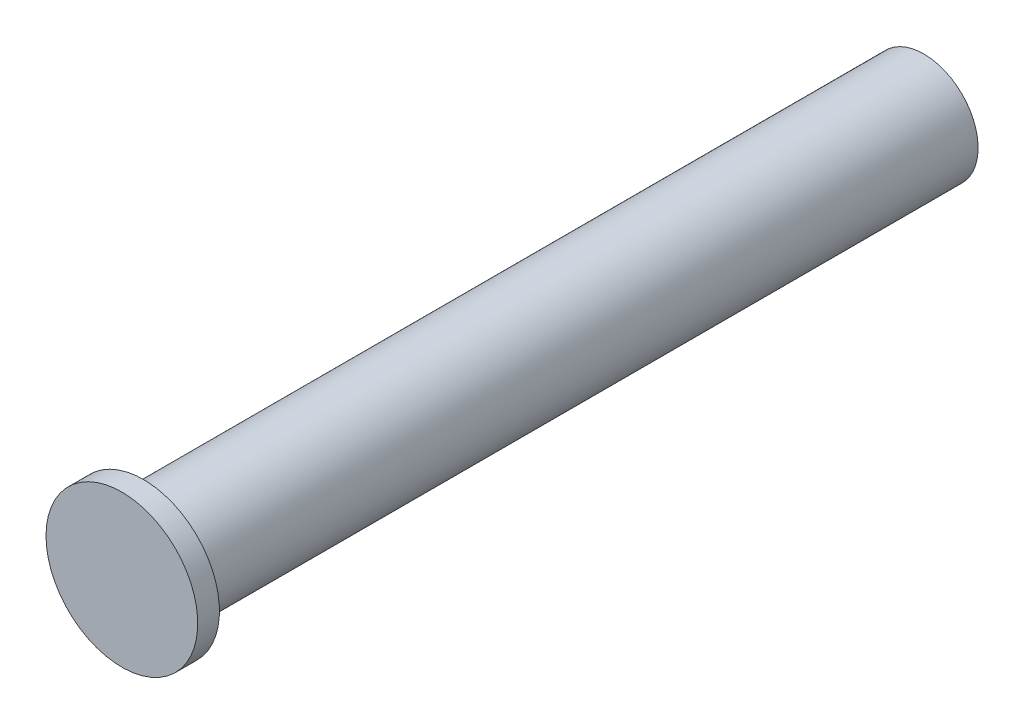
ISO-10303-21;
HEADER;
FILE_DESCRIPTION(('STEP AP214'),'2;1');
FILE_NAME('part.step','',(''),(''),'','','');
FILE_SCHEMA(('AUTOMOTIVE_DESIGN { 1 0 10303 214 1 1 1 1 }'));
ENDSEC;
DATA;
#1=APPLICATION_CONTEXT('core data for automotive mechanical design processes');
#2=APPLICATION_PROTOCOL_DEFINITION('international standard','automotive_design',2000,#1);
#3=PRODUCT_CONTEXT('',#1,'mechanical');
#4=PRODUCT('Part','Part','',(#3));
#5=PRODUCT_RELATED_PRODUCT_CATEGORY('part','',(#4));
#6=PRODUCT_DEFINITION_FORMATION('','',#4);
#7=PRODUCT_DEFINITION_CONTEXT('part definition',#1,'design');
#8=PRODUCT_DEFINITION('design','',#6,#7);
#9=PRODUCT_DEFINITION_SHAPE('','',#8);
#10=(LENGTH_UNIT() NAMED_UNIT(*) SI_UNIT(.MILLI.,.METRE.));
#11=(NAMED_UNIT(*) PLANE_ANGLE_UNIT() SI_UNIT($,.RADIAN.));
#12=(NAMED_UNIT(*) SI_UNIT($,.STERADIAN.) SOLID_ANGLE_UNIT());
#13=UNCERTAINTY_MEASURE_WITH_UNIT(LENGTH_MEASURE(1.E-05),#10,'distance_accuracy_value','');
#14=(GEOMETRIC_REPRESENTATION_CONTEXT(3) GLOBAL_UNCERTAINTY_ASSIGNED_CONTEXT((#13)) GLOBAL_UNIT_ASSIGNED_CONTEXT((#10,
#11,#12)) REPRESENTATION_CONTEXT('',''));
#15=CARTESIAN_POINT('',(0.,0.,0.));
#16=DIRECTION('',(0.,0.,1.));
#17=DIRECTION('',(1.,0.,0.));
#18=AXIS2_PLACEMENT_3D('',#15,#16,#17);
#19=CARTESIAN_POINT('',(0.,0.,0.));
#20=DIRECTION('',(0.,0.,-1.));
#21=DIRECTION('',(-1.,0.,0.));
#22=AXIS2_PLACEMENT_3D('',#19,#20,#21);
#23=PLANE('',#22);
#24=CARTESIAN_POINT('',(0.,0.,0.));
#25=DIRECTION('',(0.,0.,-1.));
#26=DIRECTION('',(-1.,0.,0.));
#27=AXIS2_PLACEMENT_3D('',#24,#25,#26);
#28=CIRCLE('',#27,7.);
#29=CARTESIAN_POINT('',(-7.,0.,0.));
#30=VERTEX_POINT('',#29);
#31=EDGE_CURVE('E10',#30,#30,#28,.T.);
#32=ORIENTED_EDGE('',*,*,#31,.F.);
#33=EDGE_LOOP('',(#32));
#34=FACE_BOUND('',#33,.T.);
#35=ADVANCED_FACE('F29',(#34),#23,.F.);
#36=CARTESIAN_POINT('',(0.,0.,-74.));
#37=DIRECTION('',(0.,0.,-1.));
#38=DIRECTION('',(-1.,0.,0.));
#39=AXIS2_PLACEMENT_3D('',#36,#37,#38);
#40=CYLINDRICAL_SURFACE('',#39,7.);
#41=CARTESIAN_POINT('',(0.,0.,-2.));
#42=DIRECTION('',(0.,0.,-1.));
#43=DIRECTION('',(-1.,0.,0.));
#44=AXIS2_PLACEMENT_3D('',#41,#42,#43);
#45=CIRCLE('',#44,7.);
#46=CARTESIAN_POINT('',(-7.,0.,-2.));
#47=VERTEX_POINT('',#46);
#48=EDGE_CURVE('E35',#47,#47,#45,.T.);
#49=ORIENTED_EDGE('',*,*,#48,.F.);
#50=EDGE_LOOP('',(#49));
#51=FACE_BOUND('',#50,.T.);
#52=ORIENTED_EDGE('',*,*,#31,.T.);
#53=EDGE_LOOP('',(#52));
#54=FACE_BOUND('',#53,.T.);
#55=ADVANCED_FACE('F59',(#51,#54),#40,.T.);
#56=CARTESIAN_POINT('',(7.,0.,-2.));
#57=DIRECTION('',(0.,0.,1.));
#58=DIRECTION('',(1.,0.,0.));
#59=AXIS2_PLACEMENT_3D('',#56,#57,#58);
#60=PLANE('',#59);
#61=CARTESIAN_POINT('',(0.,0.,-2.));
#62=DIRECTION('',(0.,0.,-1.));
#63=DIRECTION('',(-1.,0.,0.));
#64=AXIS2_PLACEMENT_3D('',#61,#62,#63);
#65=CIRCLE('',#64,5.00000000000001);
#66=CARTESIAN_POINT('',(-5.00000000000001,0.,-2.));
#67=VERTEX_POINT('',#66);
#68=EDGE_CURVE('E39',#67,#67,#65,.T.);
#69=ORIENTED_EDGE('',*,*,#68,.F.);
#70=EDGE_LOOP('',(#69));
#71=FACE_BOUND('',#70,.T.);
#72=ORIENTED_EDGE('',*,*,#48,.T.);
#73=EDGE_LOOP('',(#72));
#74=FACE_BOUND('',#73,.T.);
#75=ADVANCED_FACE('F54',(#71,#74),#60,.F.);
#76=CARTESIAN_POINT('',(0.,0.,-74.));
#77=DIRECTION('',(0.,0.,-1.));
#78=DIRECTION('',(-1.,0.,0.));
#79=AXIS2_PLACEMENT_3D('',#76,#77,#78);
#80=CYLINDRICAL_SURFACE('',#79,5.00000000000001);
#81=CARTESIAN_POINT('',(0.,0.,-74.));
#82=DIRECTION('',(0.,0.,-1.));
#83=DIRECTION('',(-1.,0.,0.));
#84=AXIS2_PLACEMENT_3D('',#81,#82,#83);
#85=CIRCLE('',#84,5.00000000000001);
#86=CARTESIAN_POINT('',(-5.,0.,-74.));
#87=VERTEX_POINT('',#86);
#88=EDGE_CURVE('E43',#87,#87,#85,.T.);
#89=ORIENTED_EDGE('',*,*,#88,.F.);
#90=EDGE_LOOP('',(#89));
#91=FACE_BOUND('',#90,.T.);
#92=ORIENTED_EDGE('',*,*,#68,.T.);
#93=EDGE_LOOP('',(#92));
#94=FACE_BOUND('',#93,.T.);
#95=ADVANCED_FACE('F51',(#91,#94),#80,.T.);
#96=CARTESIAN_POINT('',(5.00000000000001,0.,-74.));
#97=DIRECTION('',(0.,0.,1.));
#98=DIRECTION('',(1.,0.,0.));
#99=AXIS2_PLACEMENT_3D('',#96,#97,#98);
#100=PLANE('',#99);
#101=ORIENTED_EDGE('',*,*,#88,.T.);
#102=EDGE_LOOP('',(#101));
#103=FACE_BOUND('',#102,.T.);
#104=ADVANCED_FACE('F49',(#103),#100,.F.);
#105=CLOSED_SHELL('',(#35,#55,#75,#95,#104));
#106=MANIFOLD_SOLID_BREP('B2',#105);
#107=ADVANCED_BREP_SHAPE_REPRESENTATION('',(#18,#106),#14);
#108=SHAPE_DEFINITION_REPRESENTATION(#9,#107);
ENDSEC;
END-ISO-10303-21;
